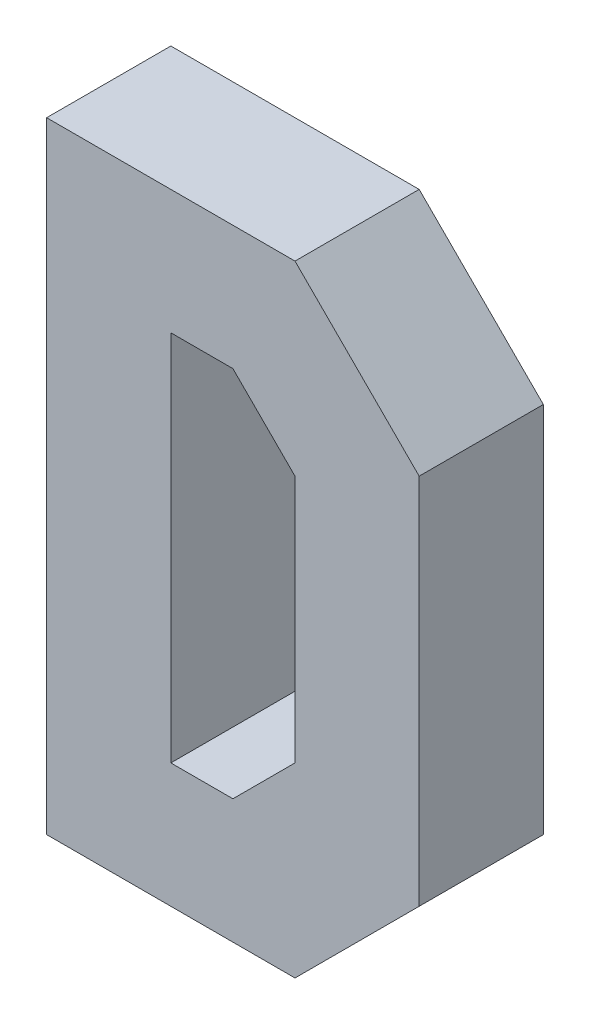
ISO-10303-21;
HEADER;
FILE_DESCRIPTION(('STEP AP214'),'2;1');
FILE_NAME('part.step','',(''),(''),'','','');
FILE_SCHEMA(('AUTOMOTIVE_DESIGN { 1 0 10303 214 1 1 1 1 }'));
ENDSEC;
DATA;
#1=APPLICATION_CONTEXT('core data for automotive mechanical design processes');
#2=APPLICATION_PROTOCOL_DEFINITION('international standard','automotive_design',2000,#1);
#3=PRODUCT_CONTEXT('',#1,'mechanical');
#4=PRODUCT('Part','Part','',(#3));
#5=PRODUCT_RELATED_PRODUCT_CATEGORY('part','',(#4));
#6=PRODUCT_DEFINITION_FORMATION('','',#4);
#7=PRODUCT_DEFINITION_CONTEXT('part definition',#1,'design');
#8=PRODUCT_DEFINITION('design','',#6,#7);
#9=PRODUCT_DEFINITION_SHAPE('','',#8);
#10=(LENGTH_UNIT() NAMED_UNIT(*) SI_UNIT(.MILLI.,.METRE.));
#11=(NAMED_UNIT(*) PLANE_ANGLE_UNIT() SI_UNIT($,.RADIAN.));
#12=(NAMED_UNIT(*) SI_UNIT($,.STERADIAN.) SOLID_ANGLE_UNIT());
#13=UNCERTAINTY_MEASURE_WITH_UNIT(LENGTH_MEASURE(1.E-05),#10,'distance_accuracy_value','');
#14=(GEOMETRIC_REPRESENTATION_CONTEXT(3) GLOBAL_UNCERTAINTY_ASSIGNED_CONTEXT((#13)) GLOBAL_UNIT_ASSIGNED_CONTEXT((#10,
#11,#12)) REPRESENTATION_CONTEXT('',''));
#15=CARTESIAN_POINT('',(0.,0.,0.));
#16=DIRECTION('',(0.,0.,1.));
#17=DIRECTION('',(1.,0.,0.));
#18=AXIS2_PLACEMENT_3D('',#15,#16,#17);
#19=CARTESIAN_POINT('',(0.,0.,10.));
#20=DIRECTION('',(0.,0.,-1.));
#21=DIRECTION('',(-1.,0.,0.));
#22=AXIS2_PLACEMENT_3D('',#19,#20,#21);
#23=PLANE('',#22);
#24=DIRECTION('',(1.,0.,0.));
#25=VECTOR('',#24,1.);
#26=CARTESIAN_POINT('',(0.,0.,10.));
#27=LINE('',#26,#25);
#28=CARTESIAN_POINT('',(0.,0.,10.));
#29=VERTEX_POINT('',#28);
#30=CARTESIAN_POINT('',(20.,0.,10.));
#31=VERTEX_POINT('',#30);
#32=EDGE_CURVE('E163',#29,#31,#27,.T.);
#33=ORIENTED_EDGE('',*,*,#32,.T.);
#34=DIRECTION('',(-0.707106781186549,-0.707106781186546,0.));
#35=VECTOR('',#34,1.);
#36=CARTESIAN_POINT('',(30.,10.,10.));
#37=LINE('',#36,#35);
#38=CARTESIAN_POINT('',(30.,10.,10.));
#39=VERTEX_POINT('',#38);
#40=EDGE_CURVE('E200',#31,#39,#37,.F.);
#41=ORIENTED_EDGE('',*,*,#40,.T.);
#42=DIRECTION('',(0.,1.,0.));
#43=VECTOR('',#42,1.);
#44=CARTESIAN_POINT('',(30.,0.,10.));
#45=LINE('',#44,#43);
#46=CARTESIAN_POINT('',(30.,40.,10.));
#47=VERTEX_POINT('',#46);
#48=EDGE_CURVE('E167',#39,#47,#45,.T.);
#49=ORIENTED_EDGE('',*,*,#48,.T.);
#50=DIRECTION('',(0.707106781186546,-0.707106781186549,0.));
#51=VECTOR('',#50,1.);
#52=CARTESIAN_POINT('',(20.,50.,10.));
#53=LINE('',#52,#51);
#54=CARTESIAN_POINT('',(20.,50.,10.));
#55=VERTEX_POINT('',#54);
#56=EDGE_CURVE('E198',#47,#55,#53,.F.);
#57=ORIENTED_EDGE('',*,*,#56,.T.);
#58=DIRECTION('',(-1.,0.,0.));
#59=VECTOR('',#58,1.);
#60=CARTESIAN_POINT('',(0.,50.,10.));
#61=LINE('',#60,#59);
#62=CARTESIAN_POINT('',(0.,50.,10.));
#63=VERTEX_POINT('',#62);
#64=EDGE_CURVE('E170',#55,#63,#61,.T.);
#65=ORIENTED_EDGE('',*,*,#64,.T.);
#66=DIRECTION('',(0.,-1.,0.));
#67=VECTOR('',#66,1.);
#68=CARTESIAN_POINT('',(0.,0.,10.));
#69=LINE('',#68,#67);
#70=EDGE_CURVE('E160',#63,#29,#69,.T.);
#71=ORIENTED_EDGE('',*,*,#70,.T.);
#72=EDGE_LOOP('',(#33,#41,#49,#57,#65,#71));
#73=FACE_BOUND('',#72,.T.);
#74=DIRECTION('',(0.,-1.,0.));
#75=VECTOR('',#74,1.);
#76=CARTESIAN_POINT('',(10.,40.,10.));
#77=LINE('',#76,#75);
#78=CARTESIAN_POINT('',(10.,40.,10.));
#79=VERTEX_POINT('',#78);
#80=CARTESIAN_POINT('',(10.,10.,10.));
#81=VERTEX_POINT('',#80);
#82=EDGE_CURVE('E121',#79,#81,#77,.T.);
#83=ORIENTED_EDGE('',*,*,#82,.F.);
#84=DIRECTION('',(-1.,0.,0.));
#85=VECTOR('',#84,1.);
#86=CARTESIAN_POINT('',(10.,40.,10.));
#87=LINE('',#86,#85);
#88=CARTESIAN_POINT('',(15.,40.,10.));
#89=VERTEX_POINT('',#88);
#90=EDGE_CURVE('E149',#89,#79,#87,.T.);
#91=ORIENTED_EDGE('',*,*,#90,.F.);
#92=DIRECTION('',(-0.707106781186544,0.707106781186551,0.));
#93=VECTOR('',#92,1.);
#94=CARTESIAN_POINT('',(27.5000000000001,27.4999999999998,10.));
#95=LINE('',#94,#93);
#96=CARTESIAN_POINT('',(20.,35.,10.));
#97=VERTEX_POINT('',#96);
#98=EDGE_CURVE('E11',#89,#97,#95,.F.);
#99=ORIENTED_EDGE('',*,*,#98,.T.);
#100=DIRECTION('',(0.,1.,0.));
#101=VECTOR('',#100,1.);
#102=CARTESIAN_POINT('',(20.,40.,10.));
#103=LINE('',#102,#101);
#104=CARTESIAN_POINT('',(20.,15.,10.));
#105=VERTEX_POINT('',#104);
#106=EDGE_CURVE('E146',#105,#97,#103,.T.);
#107=ORIENTED_EDGE('',*,*,#106,.F.);
#108=DIRECTION('',(0.707106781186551,0.707106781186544,0.));
#109=VECTOR('',#108,1.);
#110=CARTESIAN_POINT('',(2.4999999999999,-2.49999999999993,10.));
#111=LINE('',#110,#109);
#112=CARTESIAN_POINT('',(15.,10.,10.));
#113=VERTEX_POINT('',#112);
#114=EDGE_CURVE('E145',#105,#113,#111,.F.);
#115=ORIENTED_EDGE('',*,*,#114,.T.);
#116=DIRECTION('',(1.,0.,0.));
#117=VECTOR('',#116,1.);
#118=CARTESIAN_POINT('',(10.,10.,10.));
#119=LINE('',#118,#117);
#120=EDGE_CURVE('E131',#81,#113,#119,.T.);
#121=ORIENTED_EDGE('',*,*,#120,.F.);
#122=EDGE_LOOP('',(#83,#91,#99,#107,#115,#121));
#123=FACE_BOUND('',#122,.T.);
#124=ADVANCED_FACE('F33',(#73,#123),#23,.F.);
#125=CARTESIAN_POINT('',(0.,0.,0.));
#126=DIRECTION('',(0.,0.,-1.));
#127=DIRECTION('',(-1.,0.,0.));
#128=AXIS2_PLACEMENT_3D('',#125,#126,#127);
#129=PLANE('',#128);
#130=DIRECTION('',(0.,1.,0.));
#131=VECTOR('',#130,1.);
#132=CARTESIAN_POINT('',(30.,0.,0.));
#133=LINE('',#132,#131);
#134=CARTESIAN_POINT('',(30.,10.,0.));
#135=VERTEX_POINT('',#134);
#136=CARTESIAN_POINT('',(30.,40.,0.));
#137=VERTEX_POINT('',#136);
#138=EDGE_CURVE('E178',#135,#137,#133,.T.);
#139=ORIENTED_EDGE('',*,*,#138,.F.);
#140=DIRECTION('',(0.707106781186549,0.707106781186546,0.));
#141=VECTOR('',#140,1.);
#142=CARTESIAN_POINT('',(9.99999999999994,-9.99999999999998,0.));
#143=LINE('',#142,#141);
#144=CARTESIAN_POINT('',(20.,0.,0.));
#145=VERTEX_POINT('',#144);
#146=EDGE_CURVE('E194',#135,#145,#143,.F.);
#147=ORIENTED_EDGE('',*,*,#146,.T.);
#148=DIRECTION('',(1.,0.,0.));
#149=VECTOR('',#148,1.);
#150=CARTESIAN_POINT('',(0.,0.,0.));
#151=LINE('',#150,#149);
#152=CARTESIAN_POINT('',(0.,0.,0.));
#153=VERTEX_POINT('',#152);
#154=EDGE_CURVE('E175',#153,#145,#151,.T.);
#155=ORIENTED_EDGE('',*,*,#154,.F.);
#156=DIRECTION('',(0.,-1.,0.));
#157=VECTOR('',#156,1.);
#158=CARTESIAN_POINT('',(0.,0.,0.));
#159=LINE('',#158,#157);
#160=CARTESIAN_POINT('',(0.,50.,0.));
#161=VERTEX_POINT('',#160);
#162=EDGE_CURVE('E141',#161,#153,#159,.T.);
#163=ORIENTED_EDGE('',*,*,#162,.F.);
#164=DIRECTION('',(-1.,0.,0.));
#165=VECTOR('',#164,1.);
#166=CARTESIAN_POINT('',(0.,50.,0.));
#167=LINE('',#166,#165);
#168=CARTESIAN_POINT('',(20.,50.,0.));
#169=VERTEX_POINT('',#168);
#170=EDGE_CURVE('E164',#169,#161,#167,.T.);
#171=ORIENTED_EDGE('',*,*,#170,.F.);
#172=DIRECTION('',(-0.707106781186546,0.707106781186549,0.));
#173=VECTOR('',#172,1.);
#174=CARTESIAN_POINT('',(35.,34.9999999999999,0.));
#175=LINE('',#174,#173);
#176=EDGE_CURVE('E192',#169,#137,#175,.F.);
#177=ORIENTED_EDGE('',*,*,#176,.T.);
#178=EDGE_LOOP('',(#139,#147,#155,#163,#171,#177));
#179=FACE_BOUND('',#178,.T.);
#180=DIRECTION('',(0.,1.,0.));
#181=VECTOR('',#180,1.);
#182=CARTESIAN_POINT('',(20.,40.,0.));
#183=LINE('',#182,#181);
#184=CARTESIAN_POINT('',(20.,15.,0.));
#185=VERTEX_POINT('',#184);
#186=CARTESIAN_POINT('',(20.,35.,0.));
#187=VERTEX_POINT('',#186);
#188=EDGE_CURVE('E156',#185,#187,#183,.T.);
#189=ORIENTED_EDGE('',*,*,#188,.T.);
#190=DIRECTION('',(0.707106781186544,-0.707106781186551,0.));
#191=VECTOR('',#190,1.);
#192=CARTESIAN_POINT('',(20.,35.,0.));
#193=LINE('',#192,#191);
#194=CARTESIAN_POINT('',(15.,40.,0.));
#195=VERTEX_POINT('',#194);
#196=EDGE_CURVE('E41',#187,#195,#193,.F.);
#197=ORIENTED_EDGE('',*,*,#196,.T.);
#198=DIRECTION('',(-1.,0.,0.));
#199=VECTOR('',#198,1.);
#200=CARTESIAN_POINT('',(10.,40.,0.));
#201=LINE('',#200,#199);
#202=CARTESIAN_POINT('',(10.,40.,0.));
#203=VERTEX_POINT('',#202);
#204=EDGE_CURVE('E132',#195,#203,#201,.T.);
#205=ORIENTED_EDGE('',*,*,#204,.T.);
#206=DIRECTION('',(0.,-1.,0.));
#207=VECTOR('',#206,1.);
#208=CARTESIAN_POINT('',(10.,40.,0.));
#209=LINE('',#208,#207);
#210=CARTESIAN_POINT('',(10.,10.,0.));
#211=VERTEX_POINT('',#210);
#212=EDGE_CURVE('E153',#203,#211,#209,.T.);
#213=ORIENTED_EDGE('',*,*,#212,.T.);
#214=DIRECTION('',(1.,0.,0.));
#215=VECTOR('',#214,1.);
#216=CARTESIAN_POINT('',(10.,10.,0.));
#217=LINE('',#216,#215);
#218=CARTESIAN_POINT('',(15.,10.,0.));
#219=VERTEX_POINT('',#218);
#220=EDGE_CURVE('E140',#211,#219,#217,.T.);
#221=ORIENTED_EDGE('',*,*,#220,.T.);
#222=DIRECTION('',(-0.707106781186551,-0.707106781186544,0.));
#223=VECTOR('',#222,1.);
#224=CARTESIAN_POINT('',(15.,10.,0.));
#225=LINE('',#224,#223);
#226=EDGE_CURVE('E213',#219,#185,#225,.F.);
#227=ORIENTED_EDGE('',*,*,#226,.T.);
#228=EDGE_LOOP('',(#189,#197,#205,#213,#221,#227));
#229=FACE_BOUND('',#228,.T.);
#230=ADVANCED_FACE('F216',(#179,#229),#129,.T.);
#231=CARTESIAN_POINT('',(0.,0.,10.));
#232=DIRECTION('',(1.,0.,0.));
#233=DIRECTION('',(0.,0.,-1.));
#234=AXIS2_PLACEMENT_3D('',#231,#232,#233);
#235=PLANE('',#234);
#236=ORIENTED_EDGE('',*,*,#162,.T.);
#237=DIRECTION('',(0.,0.,-1.));
#238=VECTOR('',#237,1.);
#239=CARTESIAN_POINT('',(0.,0.,10.));
#240=LINE('',#239,#238);
#241=EDGE_CURVE('E184',#29,#153,#240,.T.);
#242=ORIENTED_EDGE('',*,*,#241,.F.);
#243=ORIENTED_EDGE('',*,*,#70,.F.);
#244=DIRECTION('',(0.,0.,-1.));
#245=VECTOR('',#244,1.);
#246=CARTESIAN_POINT('',(0.,50.,10.));
#247=LINE('',#246,#245);
#248=EDGE_CURVE('E172',#63,#161,#247,.T.);
#249=ORIENTED_EDGE('',*,*,#248,.T.);
#250=EDGE_LOOP('',(#236,#242,#243,#249));
#251=FACE_BOUND('',#250,.T.);
#252=ADVANCED_FACE('F239',(#251),#235,.F.);
#253=CARTESIAN_POINT('',(0.,0.,10.));
#254=DIRECTION('',(0.,1.,0.));
#255=DIRECTION('',(0.,0.,1.));
#256=AXIS2_PLACEMENT_3D('',#253,#254,#255);
#257=PLANE('',#256);
#258=ORIENTED_EDGE('',*,*,#154,.T.);
#259=DIRECTION('',(0.,0.,1.));
#260=VECTOR('',#259,1.);
#261=CARTESIAN_POINT('',(20.,0.,10.));
#262=LINE('',#261,#260);
#263=EDGE_CURVE('E196',#145,#31,#262,.T.);
#264=ORIENTED_EDGE('',*,*,#263,.T.);
#265=ORIENTED_EDGE('',*,*,#32,.F.);
#266=ORIENTED_EDGE('',*,*,#241,.T.);
#267=EDGE_LOOP('',(#258,#264,#265,#266));
#268=FACE_BOUND('',#267,.T.);
#269=ADVANCED_FACE('F252',(#268),#257,.F.);
#270=CARTESIAN_POINT('',(30.,0.,10.));
#271=DIRECTION('',(-1.,0.,0.));
#272=DIRECTION('',(0.,0.,1.));
#273=AXIS2_PLACEMENT_3D('',#270,#271,#272);
#274=PLANE('',#273);
#275=ORIENTED_EDGE('',*,*,#48,.F.);
#276=DIRECTION('',(0.,0.,-1.));
#277=VECTOR('',#276,1.);
#278=CARTESIAN_POINT('',(30.,10.,10.));
#279=LINE('',#278,#277);
#280=EDGE_CURVE('E189',#39,#135,#279,.T.);
#281=ORIENTED_EDGE('',*,*,#280,.T.);
#282=ORIENTED_EDGE('',*,*,#138,.T.);
#283=DIRECTION('',(0.,0.,1.));
#284=VECTOR('',#283,1.);
#285=CARTESIAN_POINT('',(30.,40.,10.));
#286=LINE('',#285,#284);
#287=EDGE_CURVE('E187',#137,#47,#286,.T.);
#288=ORIENTED_EDGE('',*,*,#287,.T.);
#289=EDGE_LOOP('',(#275,#281,#282,#288));
#290=FACE_BOUND('',#289,.T.);
#291=ADVANCED_FACE('F248',(#290),#274,.F.);
#292=CARTESIAN_POINT('',(0.,50.,10.));
#293=DIRECTION('',(0.,-1.,0.));
#294=DIRECTION('',(0.,0.,-1.));
#295=AXIS2_PLACEMENT_3D('',#292,#293,#294);
#296=PLANE('',#295);
#297=ORIENTED_EDGE('',*,*,#64,.F.);
#298=DIRECTION('',(0.,0.,-1.));
#299=VECTOR('',#298,1.);
#300=CARTESIAN_POINT('',(20.,50.,10.));
#301=LINE('',#300,#299);
#302=EDGE_CURVE('E202',#55,#169,#301,.T.);
#303=ORIENTED_EDGE('',*,*,#302,.T.);
#304=ORIENTED_EDGE('',*,*,#170,.T.);
#305=ORIENTED_EDGE('',*,*,#248,.F.);
#306=EDGE_LOOP('',(#297,#303,#304,#305));
#307=FACE_BOUND('',#306,.T.);
#308=ADVANCED_FACE('F245',(#307),#296,.F.);
#309=CARTESIAN_POINT('',(10.,40.,10.));
#310=DIRECTION('',(1.,0.,0.));
#311=DIRECTION('',(0.,1.,0.));
#312=AXIS2_PLACEMENT_3D('',#309,#310,#311);
#313=PLANE('',#312);
#314=ORIENTED_EDGE('',*,*,#212,.F.);
#315=DIRECTION('',(0.,0.,-1.));
#316=VECTOR('',#315,1.);
#317=CARTESIAN_POINT('',(10.,40.,10.));
#318=LINE('',#317,#316);
#319=EDGE_CURVE('E128',#79,#203,#318,.T.);
#320=ORIENTED_EDGE('',*,*,#319,.F.);
#321=ORIENTED_EDGE('',*,*,#82,.T.);
#322=DIRECTION('',(0.,0.,-1.));
#323=VECTOR('',#322,1.);
#324=CARTESIAN_POINT('',(10.,10.,10.));
#325=LINE('',#324,#323);
#326=EDGE_CURVE('E125',#81,#211,#325,.T.);
#327=ORIENTED_EDGE('',*,*,#326,.T.);
#328=EDGE_LOOP('',(#314,#320,#321,#327));
#329=FACE_BOUND('',#328,.T.);
#330=ADVANCED_FACE('F124',(#329),#313,.T.);
#331=CARTESIAN_POINT('',(10.,10.,10.));
#332=DIRECTION('',(0.,1.,0.));
#333=DIRECTION('',(0.,0.,1.));
#334=AXIS2_PLACEMENT_3D('',#331,#332,#333);
#335=PLANE('',#334);
#336=ORIENTED_EDGE('',*,*,#120,.T.);
#337=DIRECTION('',(0.,0.,-1.));
#338=VECTOR('',#337,1.);
#339=CARTESIAN_POINT('',(15.,10.,0.));
#340=LINE('',#339,#338);
#341=EDGE_CURVE('E205',#113,#219,#340,.T.);
#342=ORIENTED_EDGE('',*,*,#341,.T.);
#343=ORIENTED_EDGE('',*,*,#220,.F.);
#344=ORIENTED_EDGE('',*,*,#326,.F.);
#345=EDGE_LOOP('',(#336,#342,#343,#344));
#346=FACE_BOUND('',#345,.T.);
#347=ADVANCED_FACE('F136',(#346),#335,.T.);
#348=CARTESIAN_POINT('',(20.,40.,10.));
#349=DIRECTION('',(-1.,0.,0.));
#350=DIRECTION('',(0.,-1.,0.));
#351=AXIS2_PLACEMENT_3D('',#348,#349,#350);
#352=PLANE('',#351);
#353=ORIENTED_EDGE('',*,*,#188,.F.);
#354=DIRECTION('',(0.,0.,1.));
#355=VECTOR('',#354,1.);
#356=CARTESIAN_POINT('',(20.,15.,10.));
#357=LINE('',#356,#355);
#358=EDGE_CURVE('E210',#185,#105,#357,.T.);
#359=ORIENTED_EDGE('',*,*,#358,.T.);
#360=ORIENTED_EDGE('',*,*,#106,.T.);
#361=DIRECTION('',(0.,0.,-1.));
#362=VECTOR('',#361,1.);
#363=CARTESIAN_POINT('',(20.,35.,0.));
#364=LINE('',#363,#362);
#365=EDGE_CURVE('E207',#97,#187,#364,.T.);
#366=ORIENTED_EDGE('',*,*,#365,.T.);
#367=EDGE_LOOP('',(#353,#359,#360,#366));
#368=FACE_BOUND('',#367,.T.);
#369=ADVANCED_FACE('F220',(#368),#352,.T.);
#370=CARTESIAN_POINT('',(10.,40.,10.));
#371=DIRECTION('',(0.,-1.,0.));
#372=DIRECTION('',(0.,0.,-1.));
#373=AXIS2_PLACEMENT_3D('',#370,#371,#372);
#374=PLANE('',#373);
#375=ORIENTED_EDGE('',*,*,#204,.F.);
#376=DIRECTION('',(0.,0.,1.));
#377=VECTOR('',#376,1.);
#378=CARTESIAN_POINT('',(15.,40.,10.));
#379=LINE('',#378,#377);
#380=EDGE_CURVE('E48',#195,#89,#379,.T.);
#381=ORIENTED_EDGE('',*,*,#380,.T.);
#382=ORIENTED_EDGE('',*,*,#90,.T.);
#383=ORIENTED_EDGE('',*,*,#319,.T.);
#384=EDGE_LOOP('',(#375,#381,#382,#383));
#385=FACE_BOUND('',#384,.T.);
#386=ADVANCED_FACE('F261',(#385),#374,.T.);
#387=CARTESIAN_POINT('',(30.,10.,10.));
#388=DIRECTION('',(-0.707106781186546,0.707106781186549,0.));
#389=DIRECTION('',(0.,0.,-1.));
#390=AXIS2_PLACEMENT_3D('',#387,#388,#389);
#391=PLANE('',#390);
#392=ORIENTED_EDGE('',*,*,#40,.F.);
#393=ORIENTED_EDGE('',*,*,#263,.F.);
#394=ORIENTED_EDGE('',*,*,#146,.F.);
#395=ORIENTED_EDGE('',*,*,#280,.F.);
#396=EDGE_LOOP('',(#392,#393,#394,#395));
#397=FACE_BOUND('',#396,.T.);
#398=ADVANCED_FACE('F230',(#397),#391,.F.);
#399=CARTESIAN_POINT('',(20.,50.,10.));
#400=DIRECTION('',(-0.707106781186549,-0.707106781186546,0.));
#401=DIRECTION('',(0.,0.,-1.));
#402=AXIS2_PLACEMENT_3D('',#399,#400,#401);
#403=PLANE('',#402);
#404=ORIENTED_EDGE('',*,*,#56,.F.);
#405=ORIENTED_EDGE('',*,*,#287,.F.);
#406=ORIENTED_EDGE('',*,*,#176,.F.);
#407=ORIENTED_EDGE('',*,*,#302,.F.);
#408=EDGE_LOOP('',(#404,#405,#406,#407));
#409=FACE_BOUND('',#408,.T.);
#410=ADVANCED_FACE('F224',(#409),#403,.F.);
#411=CARTESIAN_POINT('',(15.,10.,10.));
#412=DIRECTION('',(-0.707106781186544,0.707106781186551,0.));
#413=DIRECTION('',(0.,0.,1.));
#414=AXIS2_PLACEMENT_3D('',#411,#412,#413);
#415=PLANE('',#414);
#416=ORIENTED_EDGE('',*,*,#114,.F.);
#417=ORIENTED_EDGE('',*,*,#358,.F.);
#418=ORIENTED_EDGE('',*,*,#226,.F.);
#419=ORIENTED_EDGE('',*,*,#341,.F.);
#420=EDGE_LOOP('',(#416,#417,#418,#419));
#421=FACE_BOUND('',#420,.T.);
#422=ADVANCED_FACE('F222',(#421),#415,.T.);
#423=CARTESIAN_POINT('',(20.,35.,10.));
#424=DIRECTION('',(-0.707106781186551,-0.707106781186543,0.));
#425=DIRECTION('',(0.,0.,1.));
#426=AXIS2_PLACEMENT_3D('',#423,#424,#425);
#427=PLANE('',#426);
#428=ORIENTED_EDGE('',*,*,#98,.F.);
#429=ORIENTED_EDGE('',*,*,#380,.F.);
#430=ORIENTED_EDGE('',*,*,#196,.F.);
#431=ORIENTED_EDGE('',*,*,#365,.F.);
#432=EDGE_LOOP('',(#428,#429,#430,#431));
#433=FACE_BOUND('',#432,.T.);
#434=ADVANCED_FACE('F35',(#433),#427,.T.);
#435=CLOSED_SHELL('',(#124,#230,#252,#269,#291,#308,#330,#347,#369,#386,#398,#410,#422,#434));
#436=MANIFOLD_SOLID_BREP('B2',#435);
#437=ADVANCED_BREP_SHAPE_REPRESENTATION('',(#18,#436),#14);
#438=SHAPE_DEFINITION_REPRESENTATION(#9,#437);
ENDSEC;
END-ISO-10303-21;
